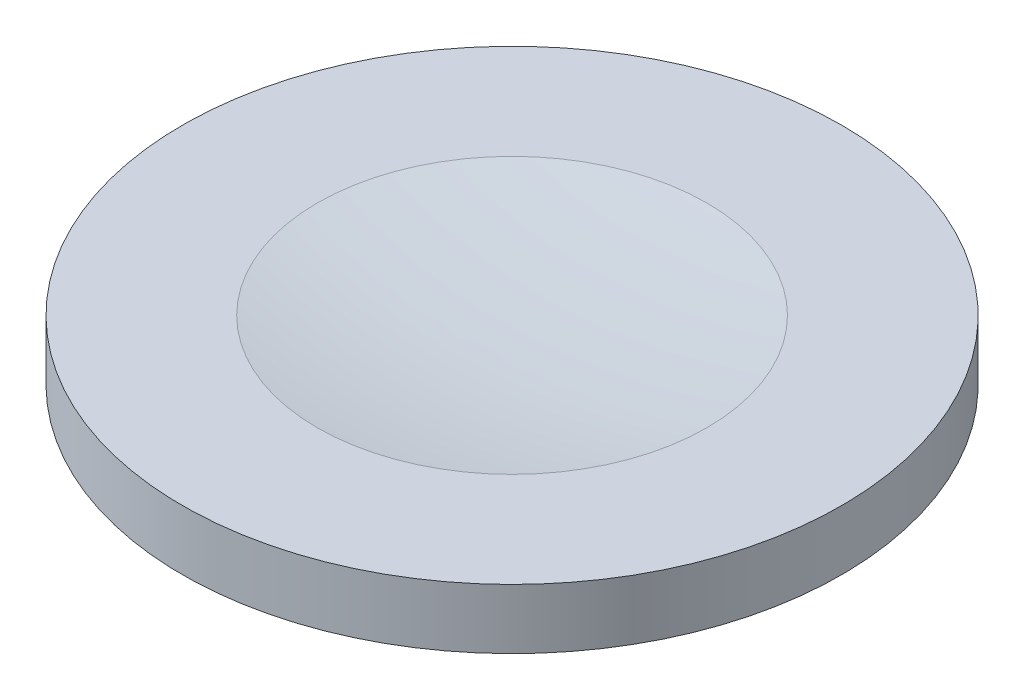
from build123d import *


with BuildPart() as part:
    # Esquisse1 → R_volution1 (revolve)
    with BuildSketch(Plane.XY, mode=Mode.PRIVATE) as r_volution1_sk:
        with BuildLine():
            Line((-3, 3), (0, 3))
            Line((0, 3), (0, 5))
            ThreePointArc((0, 5), (-3.259601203, 5.125184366), (-6.5, 5.5))
            Line((-6.5, 5.5), (-11, 5.5))
            Line((-11, 5.5), (-11, 3.5))
            Line((-11, 3.5), (-5.5, 3.5))
            Line((-5.5, 3.5), (-5.5, 3))
            Line((-5.5, 3), (-4, 3))
            Line((-4, 3), (-4, 0))
            Line((-4, 0), (-3, 0))
            Line((-3, 0), (-3, 3))
        make_face()
    revolve(r_volution1_sk.sketch.rotate(Axis((0, 5.5, 0), (0, 1, 0)), 270), axis=Axis((0, 5.5, 0), (0, 1, 0)))


solid = part.part
